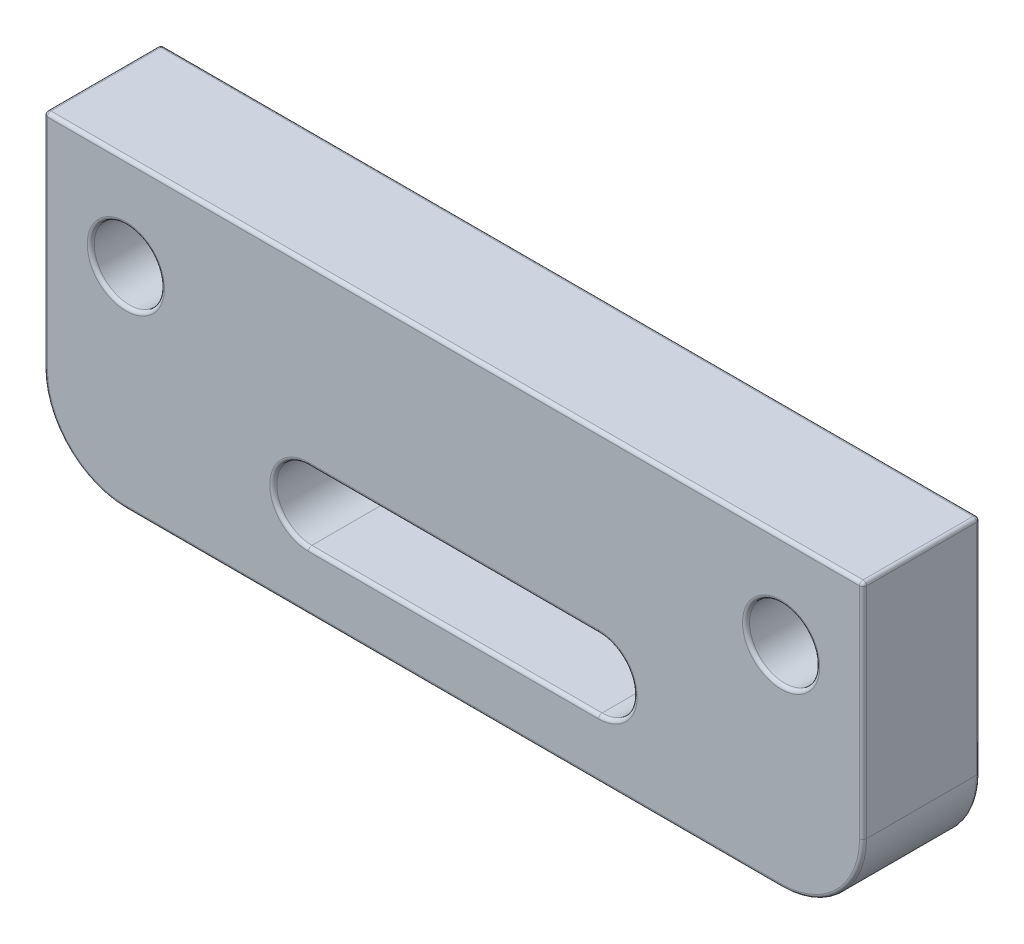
from build123d import *

# Parameters (mm, degrees)
SKETCH1_R               = 1
SKETCH1_R_2             = 1.5
SKETCH1_R_3             = 2
SKETCH1_W               = 23
SKETCH1_H               = 12
BOSS_EXTRUDE1_DEPTH     = 5
FILLET1_R               = 3.5
CUT_EXTRUDE1_DEPTH      = 32.737202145
CUT_EXTRUDE1_DEPTH_BACK = 32.737202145
FILLET3_R               = 0.15


with BuildPart() as part:
    # Sketch1 → Boss-Extrude1 (new body)
    with BuildSketch(Plane.XY):
        with BuildLine():
            Line((-17.5, 9), (-17.5, -19))
            Line((-17.5, -19), (17.5, -19))
            Line((17.5, -19), (17.5, 9))
            ThreePointArc((17.5, 9), (0, 26), (-17.5, 9))
        make_face()
        with Locations((-14, 0)):
            Circle(SKETCH1_R, mode=Mode.SUBTRACT)
        with Locations((-14, -10)):
            Circle(SKETCH1_R_2, mode=Mode.SUBTRACT)
        with Locations((-8.5, 16)):
            Circle(SKETCH1_R_3, mode=Mode.SUBTRACT)
        with Locations(Location((14, -10, 0), (0, 0, 180))):
            Circle(SKETCH1_R_2, mode=Mode.SUBTRACT)
        with Locations(Location((14, 0, 0), (0, 0, 180))):
            Circle(SKETCH1_R, mode=Mode.SUBTRACT)
        with Locations(Location((8.5, 16, 0), (0, 0, 180))):
            Circle(SKETCH1_R_3, mode=Mode.SUBTRACT)
        Rectangle(SKETCH1_W, SKETCH1_H, mode=Mode.SUBTRACT)
        with BuildLine():
            Line((-6.2, -13.5), (6.2, -13.5))
            ThreePointArc((6.2, -13.5), (7.7, -15), (6.2, -16.5))
            Line((6.2, -16.5), (-6.2, -16.5))
            ThreePointArc((-6.2, -16.5), (-7.7, -15), (-6.2, -13.5))
        make_face(mode=Mode.SUBTRACT)
    extrude(amount=BOSS_EXTRUDE1_DEPTH)

    # Fillet1
    fillet1_edges = [part.edges().sort_by_distance(p)[0] for p in [
        (17.5, -19, 2.5),
        (-17.5, -19, 2.5),
    ]]
    fillet(fillet1_edges, radius=FILLET1_R)

    # Sketch2 → Cut-Extrude1 (cut, two sides: drawn at the far end of the back side and taken through both)
    with BuildSketch(Plane.XY.offset(5).offset(-CUT_EXTRUDE1_DEPTH_BACK)):
        Polygon((-142.935501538, -6), (-22.5, -6), (27.5, -6), (147.935501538, -6), (147.935501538, 234.871003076), (-142.935501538, 234.871003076), align=None)
    extrude(amount=CUT_EXTRUDE1_DEPTH + CUT_EXTRUDE1_DEPTH_BACK, mode=Mode.SUBTRACT)

    # Fillet3
    fillet3_edges = [part.edges().sort_by_distance(p)[0] for p in [
        (0, -6, 0),
        (0, -6, 5),
        (-15.5, -10, 0),
        (-15.5, -10, 5),
        (-7.7, -15, 0),
        (0, -16.5, 0),
        (7.7, -15, 0),
        (0, -13.5, 0),
        (-7.7, -15, 5),
        (0, -16.5, 5),
        (7.7, -15, 5),
        (0, -13.5, 5),
        (15.5, -10, 0),
        (15.5, -10, 5),
        (17.5, -10.75, 0),
        (17.5, -10.75, 5),
        (0, -19, 0),
        (-16.474873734, -17.974873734, 0),
        (16.474873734, -17.974873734, 0),
        (0, -19, 5),
        (-16.474873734, -17.974873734, 5),
        (16.474873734, -17.974873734, 5),
        (-17.5, -10.75, 0),
        (-17.5, -10.75, 5),
        (-17.5, -6, 2.5),
        (17.5, -6, 2.5),
    ]]
    fillet(fillet3_edges, radius=FILLET3_R)


solid = part.part
